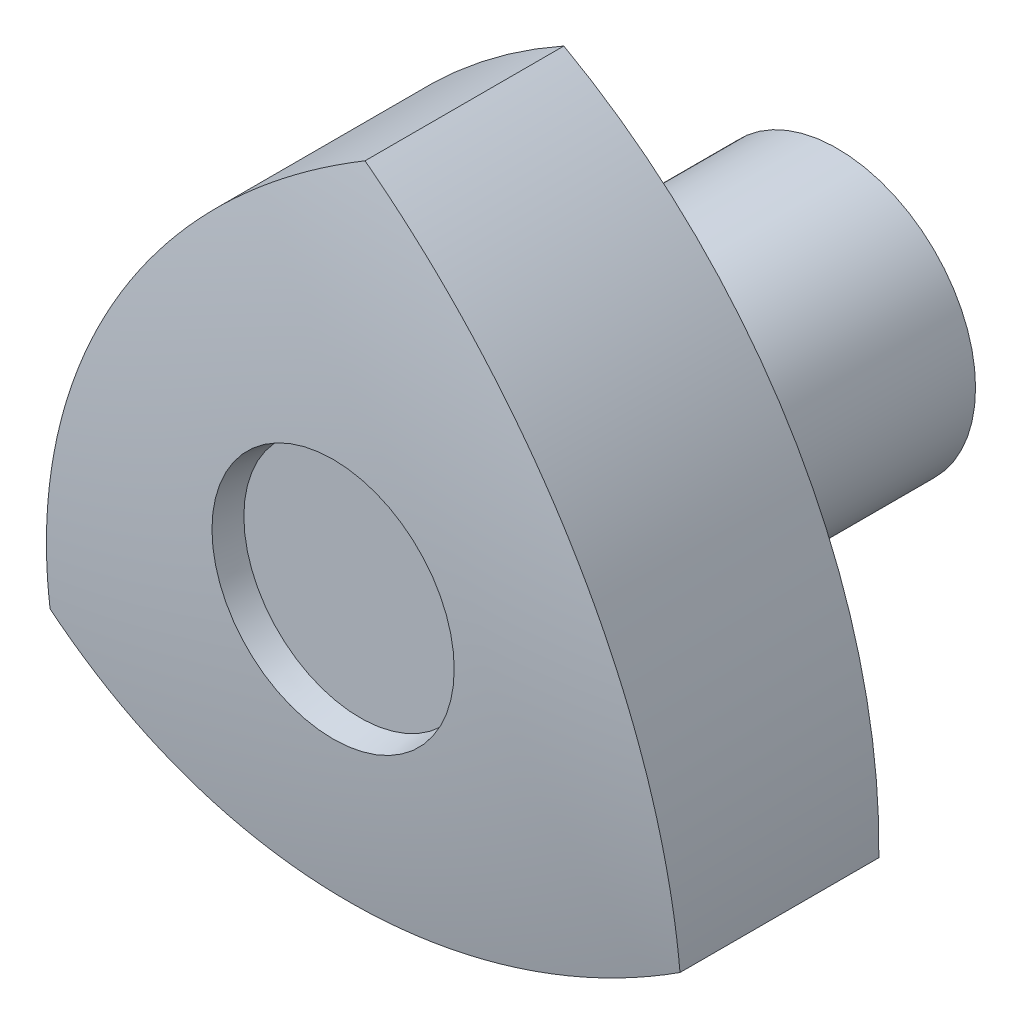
ISO-10303-21;
HEADER;
FILE_DESCRIPTION(('STEP AP214'),'2;1');
FILE_NAME('part.step','',(''),(''),'','','');
FILE_SCHEMA(('AUTOMOTIVE_DESIGN { 1 0 10303 214 1 1 1 1 }'));
ENDSEC;
DATA;
#1=APPLICATION_CONTEXT('core data for automotive mechanical design processes');
#2=APPLICATION_PROTOCOL_DEFINITION('international standard','automotive_design',2000,#1);
#3=PRODUCT_CONTEXT('',#1,'mechanical');
#4=PRODUCT('Part','Part','',(#3));
#5=PRODUCT_RELATED_PRODUCT_CATEGORY('part','',(#4));
#6=PRODUCT_DEFINITION_FORMATION('','',#4);
#7=PRODUCT_DEFINITION_CONTEXT('part definition',#1,'design');
#8=PRODUCT_DEFINITION('design','',#6,#7);
#9=PRODUCT_DEFINITION_SHAPE('','',#8);
#10=(LENGTH_UNIT() NAMED_UNIT(*) SI_UNIT(.MILLI.,.METRE.));
#11=(NAMED_UNIT(*) PLANE_ANGLE_UNIT() SI_UNIT($,.RADIAN.));
#12=(NAMED_UNIT(*) SI_UNIT($,.STERADIAN.) SOLID_ANGLE_UNIT());
#13=UNCERTAINTY_MEASURE_WITH_UNIT(LENGTH_MEASURE(1.E-05),#10,'distance_accuracy_value','');
#14=(GEOMETRIC_REPRESENTATION_CONTEXT(3) GLOBAL_UNCERTAINTY_ASSIGNED_CONTEXT((#13)) GLOBAL_UNIT_ASSIGNED_CONTEXT((#10,
#11,#12)) REPRESENTATION_CONTEXT('',''));
#15=CARTESIAN_POINT('',(0.,0.,0.));
#16=DIRECTION('',(0.,0.,1.));
#17=DIRECTION('',(1.,0.,0.));
#18=AXIS2_PLACEMENT_3D('',#15,#16,#17);
#19=CARTESIAN_POINT('',(0.,-5.,0.));
#20=DIRECTION('',(0.,0.,1.));
#21=DIRECTION('',(-1.,0.,0.));
#22=AXIS2_PLACEMENT_3D('',#19,#20,#21);
#23=PLANE('',#22);
#24=CARTESIAN_POINT('',(0.,0.,0.));
#25=DIRECTION('',(0.,0.,-1.));
#26=DIRECTION('',(0.,1.,0.));
#27=AXIS2_PLACEMENT_3D('',#24,#25,#26);
#28=CIRCLE('',#27,5.);
#29=CARTESIAN_POINT('',(0.,5.,0.));
#30=VERTEX_POINT('',#29);
#31=EDGE_CURVE('E126',#30,#30,#28,.T.);
#32=ORIENTED_EDGE('',*,*,#31,.F.);
#33=EDGE_LOOP('',(#32));
#34=FACE_BOUND('',#33,.T.);
#35=CARTESIAN_POINT('',(0.,0.,0.));
#36=DIRECTION('',(0.,0.,-1.));
#37=DIRECTION('',(1.,0.,0.));
#38=AXIS2_PLACEMENT_3D('',#35,#36,#37);
#39=CIRCLE('',#38,6.5);
#40=CARTESIAN_POINT('',(6.5,0.,0.));
#41=VERTEX_POINT('',#40);
#42=EDGE_CURVE('E117',#41,#41,#39,.F.);
#43=ORIENTED_EDGE('',*,*,#42,.F.);
#44=EDGE_LOOP('',(#43));
#45=FACE_BOUND('',#44,.T.);
#46=ADVANCED_FACE('F14',(#34,#45),#23,.F.);
#47=CARTESIAN_POINT('',(0.,0.,33.));
#48=DIRECTION('',(0.,0.,-1.));
#49=DIRECTION('',(1.,0.,0.));
#50=AXIS2_PLACEMENT_3D('',#47,#48,#49);
#51=CYLINDRICAL_SURFACE('',#50,6.5);
#52=ORIENTED_EDGE('',*,*,#42,.T.);
#53=EDGE_LOOP('',(#52));
#54=FACE_BOUND('',#53,.T.);
#55=CARTESIAN_POINT('',(0.,0.,0.200000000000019));
#56=DIRECTION('',(0.,0.,-1.));
#57=DIRECTION('',(1.,0.,0.));
#58=AXIS2_PLACEMENT_3D('',#55,#56,#57);
#59=CIRCLE('',#58,6.5);
#60=CARTESIAN_POINT('',(6.5,0.,0.200000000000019));
#61=VERTEX_POINT('',#60);
#62=EDGE_CURVE('E115',#61,#61,#59,.T.);
#63=ORIENTED_EDGE('',*,*,#62,.T.);
#64=EDGE_LOOP('',(#63));
#65=FACE_BOUND('',#64,.T.);
#66=ADVANCED_FACE('F166',(#54,#65),#51,.T.);
#67=CARTESIAN_POINT('',(0.,-6.5,0.20000000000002));
#68=DIRECTION('',(0.,0.,1.));
#69=DIRECTION('',(-1.,0.,0.));
#70=AXIS2_PLACEMENT_3D('',#67,#68,#69);
#71=PLANE('',#70);
#72=ORIENTED_EDGE('',*,*,#62,.F.);
#73=EDGE_LOOP('',(#72));
#74=FACE_BOUND('',#73,.T.);
#75=CARTESIAN_POINT('',(0.,0.,0.200000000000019));
#76=DIRECTION('',(0.,0.,-1.));
#77=DIRECTION('',(1.,0.,0.));
#78=AXIS2_PLACEMENT_3D('',#75,#76,#77);
#79=CIRCLE('',#78,9.5);
#80=CARTESIAN_POINT('',(9.5,0.,0.200000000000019));
#81=VERTEX_POINT('',#80);
#82=EDGE_CURVE('E112',#81,#81,#79,.F.);
#83=ORIENTED_EDGE('',*,*,#82,.F.);
#84=EDGE_LOOP('',(#83));
#85=FACE_BOUND('',#84,.T.);
#86=ADVANCED_FACE('F159',(#74,#85),#71,.F.);
#87=CARTESIAN_POINT('',(0.,0.,33.));
#88=DIRECTION('',(0.,0.,-1.));
#89=DIRECTION('',(1.,0.,0.));
#90=AXIS2_PLACEMENT_3D('',#87,#88,#89);
#91=CYLINDRICAL_SURFACE('',#90,9.5);
#92=ORIENTED_EDGE('',*,*,#82,.T.);
#93=EDGE_LOOP('',(#92));
#94=FACE_BOUND('',#93,.T.);
#95=CARTESIAN_POINT('',(0.,0.,19.));
#96=DIRECTION('',(0.,0.,-1.));
#97=DIRECTION('',(1.,0.,0.));
#98=AXIS2_PLACEMENT_3D('',#95,#96,#97);
#99=CIRCLE('',#98,9.5);
#100=CARTESIAN_POINT('',(9.5,0.,19.));
#101=VERTEX_POINT('',#100);
#102=EDGE_CURVE('E58',#101,#101,#99,.T.);
#103=ORIENTED_EDGE('',*,*,#102,.T.);
#104=EDGE_LOOP('',(#103));
#105=FACE_BOUND('',#104,.T.);
#106=ADVANCED_FACE('F154',(#94,#105),#91,.T.);
#107=CARTESIAN_POINT('',(0.,-9.5,19.));
#108=DIRECTION('',(0.,0.,1.));
#109=DIRECTION('',(-1.,0.,0.));
#110=AXIS2_PLACEMENT_3D('',#107,#108,#109);
#111=PLANE('',#110);
#112=ORIENTED_EDGE('',*,*,#102,.F.);
#113=EDGE_LOOP('',(#112));
#114=FACE_BOUND('',#113,.T.);
#115=CARTESIAN_POINT('',(20.4057235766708,-11.78125,19.));
#116=DIRECTION('',(0.,0.,1.));
#117=DIRECTION('',(-1.,0.,0.));
#118=AXIS2_PLACEMENT_3D('',#115,#116,#117);
#119=CIRCLE('',#118,42.0625);
#120=CARTESIAN_POINT('',(0.,25.,19.));
#121=VERTEX_POINT('',#120);
#122=CARTESIAN_POINT('',(-21.650635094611,-12.5,19.));
#123=VERTEX_POINT('',#122);
#124=EDGE_CURVE('E62',#121,#123,#119,.T.);
#125=ORIENTED_EDGE('',*,*,#124,.F.);
#126=CARTESIAN_POINT('',(-20.4057235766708,-11.78125,19.));
#127=DIRECTION('',(0.,0.,1.));
#128=DIRECTION('',(-1.,0.,0.));
#129=AXIS2_PLACEMENT_3D('',#126,#127,#128);
#130=CIRCLE('',#129,42.0625);
#131=CARTESIAN_POINT('',(21.650635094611,-12.5,19.));
#132=VERTEX_POINT('',#131);
#133=EDGE_CURVE('E60',#132,#121,#130,.T.);
#134=ORIENTED_EDGE('',*,*,#133,.F.);
#135=CARTESIAN_POINT('',(0.,23.5625,19.));
#136=DIRECTION('',(0.,0.,1.));
#137=DIRECTION('',(-1.,0.,0.));
#138=AXIS2_PLACEMENT_3D('',#135,#136,#137);
#139=CIRCLE('',#138,42.0625);
#140=EDGE_CURVE('E49',#123,#132,#139,.T.);
#141=ORIENTED_EDGE('',*,*,#140,.F.);
#142=EDGE_LOOP('',(#125,#134,#141));
#143=FACE_BOUND('',#142,.T.);
#144=ADVANCED_FACE('F61',(#114,#143),#111,.F.);
#145=CARTESIAN_POINT('',(0.,-7.99755867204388,33.));
#146=DIRECTION('',(0.,0.,-1.));
#147=DIRECTION('',(1.,0.,0.));
#148=AXIS2_PLACEMENT_3D('',#145,#146,#147);
#149=PLANE('',#148);
#150=CARTESIAN_POINT('',(0.,0.,33.));
#151=DIRECTION('',(0.,0.,1.));
#152=DIRECTION('',(-1.,0.,0.));
#153=AXIS2_PLACEMENT_3D('',#150,#151,#152);
#154=CIRCLE('',#153,7.9975586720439);
#155=CARTESIAN_POINT('',(-7.9975586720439,0.,33.));
#156=VERTEX_POINT('',#155);
#157=EDGE_CURVE('E106',#156,#156,#154,.T.);
#158=ORIENTED_EDGE('',*,*,#157,.T.);
#159=EDGE_LOOP('',(#158));
#160=FACE_BOUND('',#159,.T.);
#161=ADVANCED_FACE('F98',(#160),#149,.F.);
#162=CARTESIAN_POINT('',(0.,23.5625,50.));
#163=DIRECTION('',(0.,0.,1.));
#164=DIRECTION('',(-1.,0.,0.));
#165=AXIS2_PLACEMENT_3D('',#162,#163,#164);
#166=CYLINDRICAL_SURFACE('',#165,42.0625);
#167=DIRECTION('',(0.,0.,1.));
#168=VECTOR('',#167,1.);
#169=CARTESIAN_POINT('',(-21.650635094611,-12.5,50.));
#170=LINE('',#169,#168);
#171=CARTESIAN_POINT('',(-21.650635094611,-12.5,32.6666666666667));
#172=VERTEX_POINT('',#171);
#173=EDGE_CURVE('E56',#123,#172,#170,.T.);
#174=ORIENTED_EDGE('',*,*,#173,.F.);
#175=ORIENTED_EDGE('',*,*,#140,.T.);
#176=DIRECTION('',(0.,0.,1.));
#177=VECTOR('',#176,1.);
#178=CARTESIAN_POINT('',(21.650635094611,-12.5,50.));
#179=LINE('',#178,#177);
#180=CARTESIAN_POINT('',(21.650635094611,-12.5,32.6666666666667));
#181=VERTEX_POINT('',#180);
#182=EDGE_CURVE('E54',#181,#132,#179,.F.);
#183=ORIENTED_EDGE('',*,*,#182,.F.);
#184=CARTESIAN_POINT('',(-21.650635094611,-12.5,32.6666666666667));
#185=CARTESIAN_POINT('',(-21.1943405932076,-12.7739428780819,32.7210725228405));
#186=CARTESIAN_POINT('',(-20.7327307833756,-13.0392937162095,32.7736421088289));
#187=CARTESIAN_POINT('',(-19.7994561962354,-13.5524441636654,32.8750711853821));
#188=CARTESIAN_POINT('',(-19.3277913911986,-13.8002437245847,32.9239306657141));
#189=CARTESIAN_POINT('',(-17.8988189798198,-14.5166436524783,33.064863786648));
#190=CARTESIAN_POINT('',(-16.9273056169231,-14.9583820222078,33.1513192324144));
#191=CARTESIAN_POINT('',(-14.9525485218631,-15.7670548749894,33.308926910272));
#192=CARTESIAN_POINT('',(-13.9493050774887,-16.1339900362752,33.3800792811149));
#193=CARTESIAN_POINT('',(-11.9168614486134,-16.7907261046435,33.5069441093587));
#194=CARTESIAN_POINT('',(-10.8876599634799,-17.0805231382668,33.5626557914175));
#195=CARTESIAN_POINT('',(-8.71322365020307,-17.6041996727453,33.6630150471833));
#196=CARTESIAN_POINT('',(-7.56606681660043,-17.8304199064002,33.7061610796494));
#197=CARTESIAN_POINT('',(-5.25630188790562,-18.1866421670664,33.773954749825));
#198=CARTESIAN_POINT('',(-4.09369260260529,-18.3166367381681,33.7986009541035));
#199=CARTESIAN_POINT('',(-1.76121106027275,-18.4793721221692,33.8294365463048));
#200=CARTESIAN_POINT('',(-0.591337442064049,-18.5120941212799,33.8356223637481));
#201=CARTESIAN_POINT('',(1.74696129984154,-18.4799681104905,33.8295420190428));
#202=CARTESIAN_POINT('',(2.91538649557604,-18.4151251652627,33.8172768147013));
#203=CARTESIAN_POINT('',(5.23627149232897,-18.1889984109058,33.7743821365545));
#204=CARTESIAN_POINT('',(6.38878306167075,-18.0282268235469,33.7438501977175));
#205=CARTESIAN_POINT('',(8.67607066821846,-17.611897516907,33.6644576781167));
#206=CARTESIAN_POINT('',(9.81084459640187,-17.3563286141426,33.615594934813));
#207=CARTESIAN_POINT('',(12.0531809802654,-16.7527775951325,33.4996226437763));
#208=CARTESIAN_POINT('',(13.1607720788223,-16.4048977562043,33.4325332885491));
#209=CARTESIAN_POINT('',(15.3420037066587,-15.6193751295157,33.2802153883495));
#210=CARTESIAN_POINT('',(16.4156596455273,-15.1817737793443,33.1949952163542));
#211=CARTESIAN_POINT('',(17.827633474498,-14.5371785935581,33.0687587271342));
#212=CARTESIAN_POINT('',(18.1843879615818,-14.3681966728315,33.0356098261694));
#213=CARTESIAN_POINT('',(18.8927860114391,-14.0203702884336,32.9672544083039));
#214=CARTESIAN_POINT('',(19.2444306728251,-13.8415279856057,32.9320483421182));
#215=CARTESIAN_POINT('',(19.9417382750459,-13.4744539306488,32.8596571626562));
#216=CARTESIAN_POINT('',(20.2874110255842,-13.2862400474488,32.8224758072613));
#217=CARTESIAN_POINT('',(20.9732439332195,-12.9002459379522,32.7460856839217));
#218=CARTESIAN_POINT('',(21.3134028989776,-12.702463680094,32.7068764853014));
#219=CARTESIAN_POINT('',(21.650635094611,-12.5,32.6666666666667));
#220=B_SPLINE_CURVE_WITH_KNOTS('',3,(#184,#185,#186,#187,#188,#189,#190,#191,#192,#193,#194,
#195,#196,#197,#198,#199,#200,#201,#202,#203,#204,#205,#206,#207,#208,#209,#210,#211,#212,#213,
#214,#215,#216,#217,#218,#219),.UNSPECIFIED.,.F.,.F.,(4,2,2,2,2,2,2,2,2,2,2,2,2,2,2,2,2,4),(0.,
1.60475125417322,3.20950693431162,6.41821930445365,9.6269025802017,12.8357469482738,
16.3416238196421,19.847772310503,23.354598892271,26.861243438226,30.3493293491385,
33.8378268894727,37.3224753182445,40.8055179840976,41.9938362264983,43.1818950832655,
44.36776946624,45.5538967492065),.UNSPECIFIED.);
#221=EDGE_CURVE('E100',#172,#181,#220,.T.);
#222=ORIENTED_EDGE('',*,*,#221,.F.);
#223=EDGE_LOOP('',(#174,#175,#183,#222));
#224=FACE_BOUND('',#223,.T.);
#225=ADVANCED_FACE('F52',(#224),#166,.T.);
#226=CARTESIAN_POINT('',(-20.4057235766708,-11.78125,50.));
#227=DIRECTION('',(0.,0.,1.));
#228=DIRECTION('',(-1.,0.,0.));
#229=AXIS2_PLACEMENT_3D('',#226,#227,#228);
#230=CYLINDRICAL_SURFACE('',#229,42.0625);
#231=ORIENTED_EDGE('',*,*,#182,.T.);
#232=ORIENTED_EDGE('',*,*,#133,.T.);
#233=DIRECTION('',(0.,0.,1.));
#234=VECTOR('',#233,1.);
#235=CARTESIAN_POINT('',(0.,25.,50.));
#236=LINE('',#235,#234);
#237=CARTESIAN_POINT('',(0.,25.,32.6666666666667));
#238=VERTEX_POINT('',#237);
#239=EDGE_CURVE('E34',#238,#121,#236,.F.);
#240=ORIENTED_EDGE('',*,*,#239,.F.);
#241=CARTESIAN_POINT('',(21.650635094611,-12.5,32.6666666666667));
#242=CARTESIAN_POINT('',(21.6597293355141,-11.9678659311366,32.7210725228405));
#243=CARTESIAN_POINT('',(21.6587249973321,-11.4354246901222,32.7736421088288));
#244=CARTESIAN_POINT('',(21.6364890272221,-10.3706099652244,32.8750711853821));
#245=CARTESIAN_POINT('',(21.6152573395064,-9.83823648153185,32.9239306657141));
#246=CARTESIAN_POINT('',(21.5211916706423,-8.24251010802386,33.064863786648));
#247=CARTESIAN_POINT('',(21.417991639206,-7.1802856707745,33.1513192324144));
#248=CARTESIAN_POINT('',(21.1309443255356,-5.06575943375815,33.308926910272));
#249=CARTESIAN_POINT('',(20.9470977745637,-4.01345754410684,33.3800792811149));
#250=CARTESIAN_POINT('',(20.4996260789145,-1.9249416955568,33.5069441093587));
#251=CARTESIAN_POINT('',(20.2359969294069,-0.888728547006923,33.5626557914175));
#252=CARTESIAN_POINT('',(19.6022959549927,1.25622680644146,33.6630150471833));
#253=CARTESIAN_POINT('',(19.2246300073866,2.36280388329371,33.7061610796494));
#254=CARTESIAN_POINT('',(18.3782450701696,4.54123011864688,33.773954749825));
#255=CARTESIAN_POINT('',(17.9095190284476,5.61307657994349,33.7986009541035));
#256=CARTESIAN_POINT('',(16.8842112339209,7.71443254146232,33.8294365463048));
#257=CARTESIAN_POINT('',(16.3276125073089,8.74393381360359,33.8356223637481));
#258=CARTESIAN_POINT('',(15.1306411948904,10.7528969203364,33.8295420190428));
#259=CARTESIAN_POINT('',(14.4902729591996,11.7323613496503,33.8172768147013));
#260=CARTESIAN_POINT('',(13.1339989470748,13.6292433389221,33.7743821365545));
#261=CARTESIAN_POINT('',(12.4185108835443,14.5469618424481,33.7438501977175));
#262=CARTESIAN_POINT('',(10.9143153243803,16.3196463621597,33.6644576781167));
#263=CARTESIAN_POINT('',(10.1255991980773,17.1746049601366,33.6155949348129));
#264=CARTESIAN_POINT('',(8.48174049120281,18.8147497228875,33.4996226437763));
#265=CARTESIAN_POINT('',(7.62667216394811,19.6000118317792,33.432533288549));
#266=CARTESIAN_POINT('',(5.85577380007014,21.0962525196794,33.2802153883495));
#267=CARTESIAN_POINT('',(4.93997194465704,21.8072651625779,33.1949952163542));
#268=CARTESIAN_POINT('',(3.67574922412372,22.7077727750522,33.0687587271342));
#269=CARTESIAN_POINT('',(3.35102934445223,22.9322402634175,33.0356098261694));
#270=CARTESIAN_POINT('',(2.69560383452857,23.3718177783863,32.9672544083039));
#271=CARTESIAN_POINT('',(2.36489952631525,23.5869298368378,32.9320483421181));
#272=CARTESIAN_POINT('',(1.69835026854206,24.0072789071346,32.8596571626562));
#273=CARTESIAN_POINT('',(1.36251588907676,24.2125333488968,32.8224758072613));
#274=CARTESIAN_POINT('',(0.685318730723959,24.613485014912,32.7460856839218));
#275=CARTESIAN_POINT('',(0.34395478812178,24.8091801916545,32.7068764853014));
#276=CARTESIAN_POINT('',(0.,25.,32.6666666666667));
#277=B_SPLINE_CURVE_WITH_KNOTS('',3,(#241,#242,#243,#244,#245,#246,#247,#248,#249,#250,#251,
#252,#253,#254,#255,#256,#257,#258,#259,#260,#261,#262,#263,#264,#265,#266,#267,#268,#269,#270,
#271,#272,#273,#274,#275,#276),.UNSPECIFIED.,.F.,.F.,(4,2,2,2,2,2,2,2,2,2,2,2,2,2,2,2,2,4),(0.,
1.60475125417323,3.20950693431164,6.4182193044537,9.62690258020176,12.8357469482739,
16.3416238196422,19.847772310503,23.3545988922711,26.861243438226,30.3493293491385,
33.8378268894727,37.3224753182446,40.8055179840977,41.9938362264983,43.1818950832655,
44.36776946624,45.5538967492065),.UNSPECIFIED.);
#278=EDGE_CURVE('E66',#181,#238,#277,.T.);
#279=ORIENTED_EDGE('',*,*,#278,.F.);
#280=EDGE_LOOP('',(#231,#232,#240,#279));
#281=FACE_BOUND('',#280,.T.);
#282=ADVANCED_FACE('F64',(#281),#230,.T.);
#283=CARTESIAN_POINT('',(20.4057235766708,-11.78125,50.));
#284=DIRECTION('',(0.,0.,1.));
#285=DIRECTION('',(-1.,0.,0.));
#286=AXIS2_PLACEMENT_3D('',#283,#284,#285);
#287=CYLINDRICAL_SURFACE('',#286,42.0625);
#288=ORIENTED_EDGE('',*,*,#239,.T.);
#289=ORIENTED_EDGE('',*,*,#124,.T.);
#290=ORIENTED_EDGE('',*,*,#173,.T.);
#291=CARTESIAN_POINT('',(0.,25.,32.6666666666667));
#292=CARTESIAN_POINT('',(-0.465388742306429,24.7418088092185,32.7210725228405));
#293=CARTESIAN_POINT('',(-0.925994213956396,24.4747184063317,32.7736421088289));
#294=CARTESIAN_POINT('',(-1.83703283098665,23.9230541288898,32.8750711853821));
#295=CARTESIAN_POINT('',(-2.28746594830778,23.6384802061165,32.923930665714));
#296=CARTESIAN_POINT('',(-3.62237269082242,22.7591537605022,33.0648637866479));
#297=CARTESIAN_POINT('',(-4.49068602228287,22.1386676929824,33.1513192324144));
#298=CARTESIAN_POINT('',(-6.17839580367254,20.8328143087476,33.308926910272));
#299=CARTESIAN_POINT('',(-6.99779269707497,20.147447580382,33.3800792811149));
#300=CARTESIAN_POINT('',(-8.58276463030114,18.7156678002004,33.5069441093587));
#301=CARTESIAN_POINT('',(-9.34833696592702,17.9692516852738,33.5626557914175));
#302=CARTESIAN_POINT('',(-10.8890723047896,16.3479728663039,33.6630150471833));
#303=CARTESIAN_POINT('',(-11.6585631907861,15.4676160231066,33.7061610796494));
#304=CARTESIAN_POINT('',(-13.121943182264,13.6454120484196,33.773954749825));
#305=CARTESIAN_POINT('',(-13.8158264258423,12.7035601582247,33.7986009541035));
#306=CARTESIAN_POINT('',(-15.1230001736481,10.764939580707,33.8294365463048));
#307=CARTESIAN_POINT('',(-15.7362750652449,9.76816030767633,33.8356223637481));
#308=CARTESIAN_POINT('',(-16.8776024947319,7.72707119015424,33.8295420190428));
#309=CARTESIAN_POINT('',(-17.4056594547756,6.68276381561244,33.8172768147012));
#310=CARTESIAN_POINT('',(-18.3702704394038,4.55975507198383,33.7743821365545));
#311=CARTESIAN_POINT('',(-18.807293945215,3.48126498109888,33.7438501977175));
#312=CARTESIAN_POINT('',(-19.5903859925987,1.29225115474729,33.6644576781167));
#313=CARTESIAN_POINT('',(-19.9364437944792,0.181723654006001,33.6155949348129));
#314=CARTESIAN_POINT('',(-20.5349214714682,-2.06197212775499,33.4996226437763));
#315=CARTESIAN_POINT('',(-20.7874442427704,-3.19511407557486,33.4325332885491));
#316=CARTESIAN_POINT('',(-21.1977775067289,-5.47687739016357,33.2802153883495));
#317=CARTESIAN_POINT('',(-21.3556315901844,-6.62549138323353,33.1949952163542));
#318=CARTESIAN_POINT('',(-21.5033826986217,-8.17059418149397,33.0687587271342));
#319=CARTESIAN_POINT('',(-21.5354173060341,-8.564043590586,33.0356098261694));
#320=CARTESIAN_POINT('',(-21.5883898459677,-9.35144748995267,32.9672544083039));
#321=CARTESIAN_POINT('',(-21.6093301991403,-9.7454018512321,32.9320483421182));
#322=CARTESIAN_POINT('',(-21.6400885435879,-10.5328249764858,32.8596571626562));
#323=CARTESIAN_POINT('',(-21.649926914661,-10.926293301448,32.8224758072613));
#324=CARTESIAN_POINT('',(-21.6585626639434,-11.7132390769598,32.7460856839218));
#325=CARTESIAN_POINT('',(-21.6573576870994,-12.1067165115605,32.7068764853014));
#326=CARTESIAN_POINT('',(-21.650635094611,-12.5,32.6666666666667));
#327=B_SPLINE_CURVE_WITH_KNOTS('',3,(#291,#292,#293,#294,#295,#296,#297,#298,#299,#300,#301,
#302,#303,#304,#305,#306,#307,#308,#309,#310,#311,#312,#313,#314,#315,#316,#317,#318,#319,#320,
#321,#322,#323,#324,#325,#326),.UNSPECIFIED.,.F.,.F.,(4,2,2,2,2,2,2,2,2,2,2,2,2,2,2,2,2,4),(0.,
1.60475125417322,3.20950693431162,6.41821930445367,9.62690258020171,12.8357469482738,
16.3416238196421,19.847772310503,23.354598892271,26.861243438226,30.3493293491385,
33.8378268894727,37.3224753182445,40.8055179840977,41.9938362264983,43.1818950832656,
44.36776946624,45.5538967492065),.UNSPECIFIED.);
#328=EDGE_CURVE('E25',#238,#172,#327,.T.);
#329=ORIENTED_EDGE('',*,*,#328,.F.);
#330=EDGE_LOOP('',(#288,#289,#290,#329));
#331=FACE_BOUND('',#330,.T.);
#332=ADVANCED_FACE('F85',(#331),#287,.T.);
#333=CARTESIAN_POINT('',(0.,0.,34.8635582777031));
#334=DIRECTION('',(0.,0.,1.));
#335=DIRECTION('',(-1.,0.,0.));
#336=AXIS2_PLACEMENT_3D('',#333,#334,#335);
#337=CONICAL_SURFACE('',#336,8.32615427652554,0.174532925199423);
#338=CARTESIAN_POINT('',(0.,0.,34.8635582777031));
#339=DIRECTION('',(0.,0.,-1.));
#340=DIRECTION('',(1.,0.,0.));
#341=AXIS2_PLACEMENT_3D('',#338,#339,#340);
#342=CIRCLE('',#341,8.32615427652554);
#343=CARTESIAN_POINT('',(8.32615427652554,0.,34.8635582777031));
#344=VERTEX_POINT('',#343);
#345=EDGE_CURVE('E9',#344,#344,#342,.T.);
#346=ORIENTED_EDGE('',*,*,#345,.F.);
#347=EDGE_LOOP('',(#346));
#348=FACE_BOUND('',#347,.T.);
#349=ORIENTED_EDGE('',*,*,#157,.F.);
#350=EDGE_LOOP('',(#349));
#351=FACE_BOUND('',#350,.T.);
#352=ADVANCED_FACE('F89',(#348,#351),#337,.F.);
#353=CARTESIAN_POINT('',(0.,0.,-74.7480158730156));
#354=DIRECTION('',(0.,0.,1.));
#355=DIRECTION('',(-1.,0.,0.));
#356=AXIS2_PLACEMENT_3D('',#353,#354,#355);
#357=DEGENERATE_TOROIDAL_SURFACE('',#356,2.36574074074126,109.773511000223,.T.);
#358=ORIENTED_EDGE('',*,*,#345,.T.);
#359=EDGE_LOOP('',(#358));
#360=FACE_BOUND('',#359,.T.);
#361=ORIENTED_EDGE('',*,*,#278,.T.);
#362=ORIENTED_EDGE('',*,*,#328,.T.);
#363=ORIENTED_EDGE('',*,*,#221,.T.);
#364=EDGE_LOOP('',(#361,#362,#363));
#365=FACE_BOUND('',#364,.T.);
#366=ADVANCED_FACE('F16',(#360,#365),#357,.T.);
#367=CARTESIAN_POINT('',(0.,0.,16.));
#368=DIRECTION('',(0.,0.,-1.));
#369=DIRECTION('',(0.,1.,0.));
#370=AXIS2_PLACEMENT_3D('',#367,#368,#369);
#371=CYLINDRICAL_SURFACE('',#370,5.);
#372=CARTESIAN_POINT('',(0.,0.,16.));
#373=DIRECTION('',(0.,0.,-1.));
#374=DIRECTION('',(0.,1.,0.));
#375=AXIS2_PLACEMENT_3D('',#372,#373,#374);
#376=CIRCLE('',#375,5.);
#377=CARTESIAN_POINT('',(0.,5.00000000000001,16.));
#378=VERTEX_POINT('',#377);
#379=EDGE_CURVE('E122',#378,#378,#376,.T.);
#380=ORIENTED_EDGE('',*,*,#379,.F.);
#381=EDGE_LOOP('',(#380));
#382=FACE_BOUND('',#381,.T.);
#383=ORIENTED_EDGE('',*,*,#31,.T.);
#384=EDGE_LOOP('',(#383));
#385=FACE_BOUND('',#384,.T.);
#386=ADVANCED_FACE('F136',(#382,#385),#371,.F.);
#387=CARTESIAN_POINT('',(0.,0.,31.6666666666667));
#388=DIRECTION('',(0.,0.,1.));
#389=DIRECTION('',(-1.,0.,0.));
#390=AXIS2_PLACEMENT_3D('',#387,#388,#389);
#391=PLANE('',#390);
#392=CARTESIAN_POINT('',(0.,0.,31.6666666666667));
#393=DIRECTION('',(0.,0.,1.));
#394=DIRECTION('',(0.,-1.,0.));
#395=AXIS2_PLACEMENT_3D('',#392,#393,#394);
#396=CIRCLE('',#395,7.76245603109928);
#397=CARTESIAN_POINT('',(0.,-7.76245603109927,31.6666666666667));
#398=VERTEX_POINT('',#397);
#399=EDGE_CURVE('E19',#398,#398,#396,.F.);
#400=ORIENTED_EDGE('',*,*,#399,.T.);
#401=EDGE_LOOP('',(#400));
#402=FACE_BOUND('',#401,.T.);
#403=ADVANCED_FACE('F143',(#402),#391,.F.);
#404=CARTESIAN_POINT('',(0.,0.,31.6666666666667));
#405=DIRECTION('',(0.,0.,1.));
#406=DIRECTION('',(0.,-1.,0.));
#407=AXIS2_PLACEMENT_3D('',#404,#405,#406);
#408=CONICAL_SURFACE('',#407,7.76245603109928,0.174532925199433);
#409=ORIENTED_EDGE('',*,*,#399,.F.);
#410=EDGE_LOOP('',(#409));
#411=FACE_BOUND('',#410,.T.);
#412=ORIENTED_EDGE('',*,*,#379,.T.);
#413=EDGE_LOOP('',(#412));
#414=FACE_BOUND('',#413,.T.);
#415=ADVANCED_FACE('F173',(#411,#414),#408,.F.);
#416=CLOSED_SHELL('',(#46,#66,#86,#106,#144,#161,#225,#282,#332,#352,#366,#386,#403,#415));
#417=MANIFOLD_SOLID_BREP('B1',#416);
#418=ADVANCED_BREP_SHAPE_REPRESENTATION('',(#18,#417),#14);
#419=SHAPE_DEFINITION_REPRESENTATION(#9,#418);
ENDSEC;
END-ISO-10303-21;
